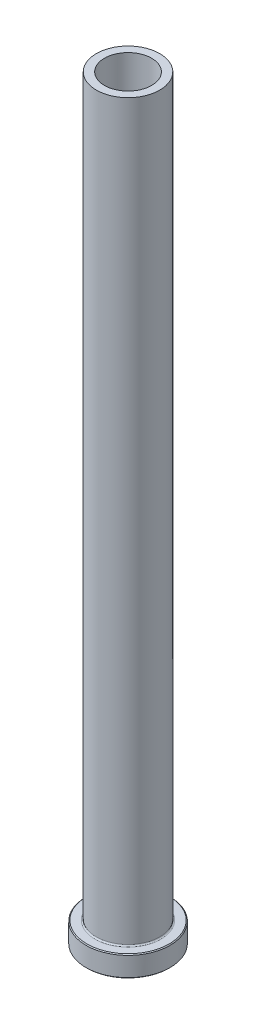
from build123d import *

# Parameters (mm, degrees)
CHAMFER1_SIZE = 0.254


with BuildPart() as part:
    # Sketch1 → Revolve1 (revolve)
    with BuildSketch(Plane.XY, mode=Mode.PRIVATE) as revolve1_sk:
        with BuildLine():
            Line((0, 0), (12.7, 0))
            Line((12.7, 0), (12.7, 6.35))
            Line((12.7, 6.35), (9.979025, 6.35))
            ThreePointArc((9.979025, 6.35), (9.698391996, 6.466241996), (9.58215, 6.746875))
            Line((9.58215, 6.746875), (9.58215, 228.6))
            Line((9.58215, 228.6), (0, 228.6))
            Line((0, 228.6), (0, 0))
        make_face()
    revolve(revolve1_sk.sketch.rotate(Axis((0, 0, 0), (0, 1, 0)), 90), axis=Axis((0, 0, 0), (0, 1, 0)))

    # Sketch2 → Cut-Revolve1 (revolve, cut)
    with BuildSketch(Plane.XY, mode=Mode.PRIVATE) as cut_revolve1_sk:
        Polygon((8.524875, 0), (8.128, 0.396875), (8.128, 154.1145), (7.14375, 168.402), (7.14375, 228.6), (0, 228.6), (0, 0), align=None)
    revolve(cut_revolve1_sk.sketch.rotate(Axis((0, 0, 0), (0, 1, 0)), 90), axis=Axis((0, 0, 0), (0, 1, 0)), mode=Mode.SUBTRACT)

    # Chamfer1
    chamfer1_edges = [part.edges().sort_by_distance(p)[0] for p in [
        (0, 6.35, 12.7),
        (0, 0, 12.7),
    ]]
    chamfer(chamfer1_edges, length=CHAMFER1_SIZE)


solid = part.part
